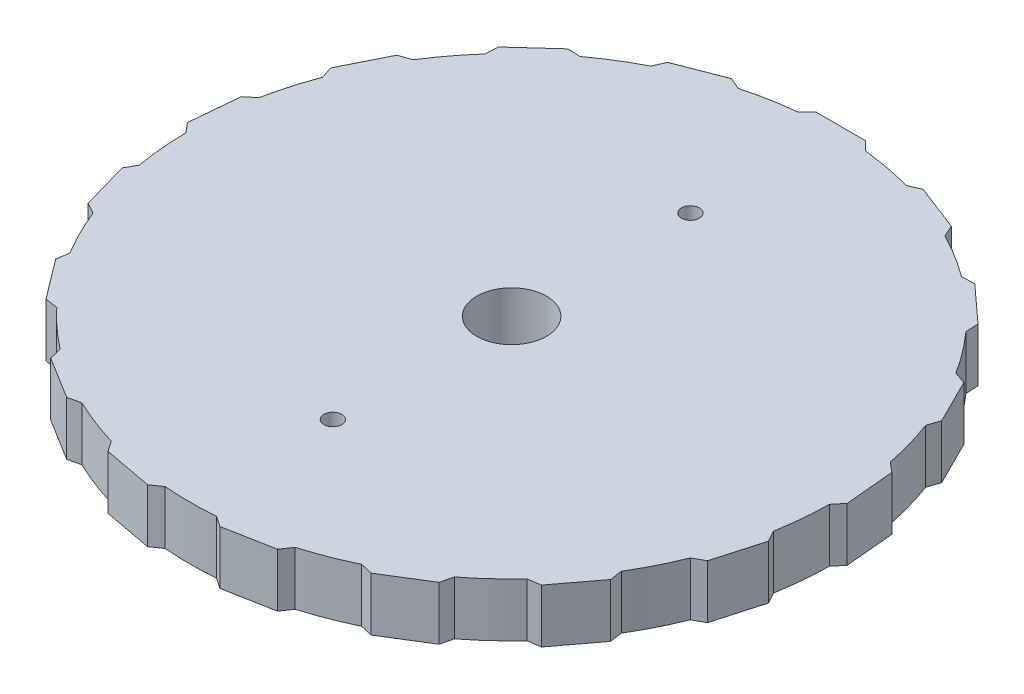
from build123d import *

# Parameters (mm, degrees)
SKETCH1_R           = 18
SKETCH1_R_2         = 1.95
SKETCH1_R_3         = 0.5
BOSS_EXTRUDE1_DEPTH = 3
BOSS_EXTRUDE2_DEPTH = 3


with BuildPart() as part:
    # Sketch1 → Boss-Extrude1 (new body)
    with BuildSketch(Plane(origin=(0, 0, 0), x_dir=(1, 0, 0), z_dir=(0, 1, 0))):
        with Locations(Location((0, 0, 0), (0, 0, 270))):
            Circle(SKETCH1_R)
        with Locations(Location((0, 0, 0), (0, 0, 270))):
            Circle(SKETCH1_R_2, mode=Mode.SUBTRACT)
        with Locations(Location((0, 10, 0), (0, 0, 270))):
            Circle(SKETCH1_R_3, mode=Mode.SUBTRACT)
        with Locations(Location((0, -10, 0), (0, 0, 90))):
            Circle(SKETCH1_R_3, mode=Mode.SUBTRACT)
    extrude(amount=BOSS_EXTRUDE1_DEPTH)

    # Sketch2 → Boss-Extrude2 (add)
    with BuildSketch(Plane(origin=(0, 0, 0), x_dir=(1, 0, 0), z_dir=(0, 1, 0))):
        Polygon((-1.381512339, 18.401394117), (1.381512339, 18.401394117), (1.881512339, 17.901394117), (-1.881512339, 17.901394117), align=None)
        Polygon((5.35912838, 17.657848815), (7.935572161, 16.659729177), (8.221187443, 16.012872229), (4.712271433, 17.372233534), align=None)
        Polygon((11.375989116, 14.529513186), (13.417888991, 12.668075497), (13.450545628, 11.961723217), (10.669636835, 14.496856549), align=None)
        Polygon((15.856459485, 9.43888629), (17.088045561, 6.965528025), (16.863333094, 6.295077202), (15.186008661, 9.663598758), align=None)
        Polygon((18.195427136, 3.073485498), (18.45036689, 0.322247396), (17.998633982, -0.221753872), (17.651425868, 3.525218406), align=None)
        Polygon((18.077001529, -3.707006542), (17.320863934, -6.364554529), (16.703119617, -6.708635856), (17.732920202, -3.089262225), align=None)
        Polygon((15.517176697, -9.986846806), (13.852082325, -12.191788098), (13.151756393, -12.289479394), (15.419485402, -9.286520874), align=None)
        Polygon((10.861671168, -14.917908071), (8.512500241, -16.372453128), (7.824175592, -16.210560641), (11.023563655, -14.229583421), align=None)
        Polygon((4.739236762, -17.834223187), (2.02325783, -18.341927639), (1.439896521, -17.942315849), (5.138848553, -17.250861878), align=None)
        Polygon((-2.02325783, -18.341927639), (-4.739236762, -17.834223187), (-5.138848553, -17.250861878), (-1.439896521, -17.942315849), align=None)
        Polygon((-8.512500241, -16.372453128), (-10.861671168, -14.917908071), (-11.023563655, -14.229583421), (-7.824175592, -16.210560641), align=None)
        Polygon((-13.852082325, -12.191788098), (-15.517176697, -9.986846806), (-15.419485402, -9.286520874), (-13.151756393, -12.289479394), align=None)
        Polygon((-17.320863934, -6.364554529), (-18.077001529, -3.707006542), (-17.732920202, -3.089262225), (-16.703119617, -6.708635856), align=None)
        Polygon((-18.45036689, 0.322247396), (-18.195427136, 3.073485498), (-17.651425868, 3.525218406), (-17.998633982, -0.221753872), align=None)
        Polygon((-17.088045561, 6.965528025), (-15.856459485, 9.43888629), (-15.186008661, 9.663598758), (-16.863333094, 6.295077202), align=None)
        Polygon((-13.417888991, 12.668075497), (-11.375989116, 14.529513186), (-10.669636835, 14.496856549), (-13.450545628, 11.961723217), align=None)
        Polygon((-7.935572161, 16.659729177), (-5.35912838, 17.657848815), (-4.712271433, 17.372233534), (-8.221187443, 16.012872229), align=None)
    extrude(amount=BOSS_EXTRUDE2_DEPTH)


solid = part.part
